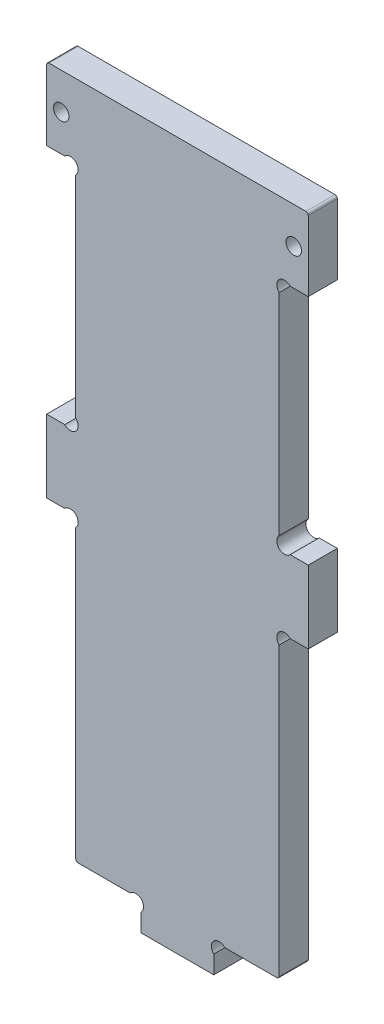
from build123d import *

# Parameters (mm, degrees)
ESQUISSE1_R      = 1.6
EXTRUSION1_DEPTH = 6


with BuildPart() as part:
    # Esquisse1 → Extrusion1 (new body)
    with BuildSketch(Plane.XY):
        with BuildLine():
            Line((-76.5, 70), (-23.5, 70))
            ThreePointArc((-23.5, 70), (-23.146446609, 69.853553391), (-23, 69.5))
            Line((-23, 69.5), (-23, 55))
            Line((-23, 55), (-26.738104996, 55))
            ThreePointArc((-26.738104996, 55), (-29.03137085, 55.03137085), (-29, 52.738104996))
            Line((-29, 52.738104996), (-29, 9.261895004))
            ThreePointArc((-29, 9.261895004), (-29.03137085, 6.96862915), (-26.738104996, 7))
            Line((-26.738104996, 7), (-23, 7))
            Line((-23, 7), (-23, -8))
            Line((-23, -8), (-26.738104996, -8))
            ThreePointArc((-26.738104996, -8), (-29.03137085, -7.96862915), (-29, -10.261895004))
            Line((-29, -10.261895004), (-29, -69.5))
            ThreePointArc((-29, -69.5), (-29.146446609, -69.853553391), (-29.5, -70))
            Line((-29.5, -70), (-40.238104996, -70))
            ThreePointArc((-40.238104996, -70), (-42.53137085, -69.96862915), (-42.5, -72.261895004))
            Line((-42.5, -72.261895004), (-42.5, -76))
            Line((-42.5, -76), (-57.5, -76))
            Line((-57.5, -76), (-57.5, -72.261895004))
            ThreePointArc((-57.5, -72.261895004), (-57.46862915, -69.96862915), (-59.761895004, -70))
            Line((-59.761895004, -70), (-70.5, -70))
            ThreePointArc((-70.5, -70), (-70.853553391, -69.853553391), (-71, -69.5))
            Line((-71, -69.5), (-71, -10.261895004))
            ThreePointArc((-71, -10.261895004), (-70.96862915, -7.96862915), (-73.261895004, -8))
            Line((-73.261895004, -8), (-77, -8))
            Line((-77, -8), (-77, 7))
            Line((-77, 7), (-73.261895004, 7))
            ThreePointArc((-73.261895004, 7), (-70.96862915, 6.96862915), (-71, 9.261895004))
            Line((-71, 9.261895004), (-71, 52.738104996))
            ThreePointArc((-71, 52.738104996), (-70.96862915, 55.03137085), (-73.261895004, 55))
            Line((-73.261895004, 55), (-77, 55))
            Line((-77, 55), (-77, 69.5))
            ThreePointArc((-77, 69.5), (-76.853553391, 69.853553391), (-76.5, 70))
        make_face()
        with Locations((-26, 62.5)):
            Circle(ESQUISSE1_R, mode=Mode.SUBTRACT)
        with Locations(Location((-74, 62.5, 0), (0, 0, 180))):
            Circle(ESQUISSE1_R, mode=Mode.SUBTRACT)
    extrude(amount=-EXTRUSION1_DEPTH)


solid = part.part
